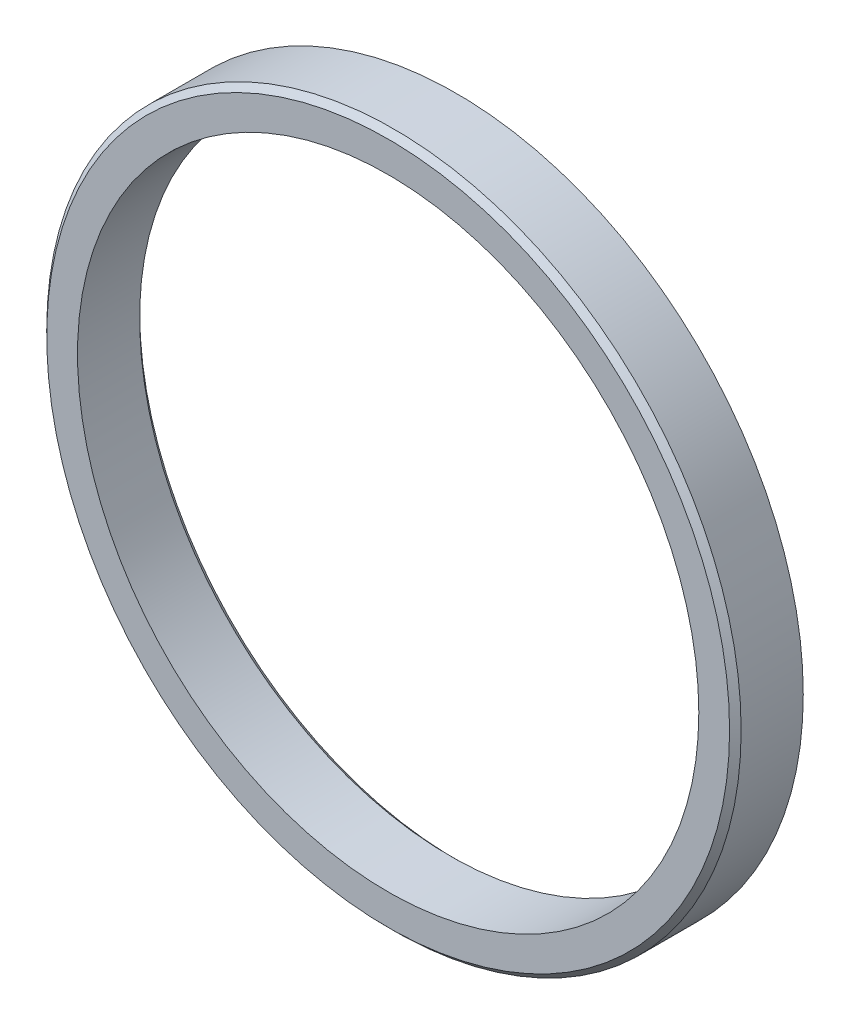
from build123d import *


with BuildPart() as part:
    # Sketch1 → Revolve1 (revolve)
    with BuildSketch(Plane(origin=(0, 0, 0), x_dir=(0, 0, -1), z_dir=(1, 0, 0)), mode=Mode.PRIVATE) as revolve1_sk:
        Polygon((-10.75, 107.5), (10.75, 107.5), (12.75, 109.5), (12.75, 120.15), (-8.75, 120.15), (-10.75, 118.15), align=None)
    revolve(revolve1_sk.sketch.rotate(Axis((0, 0, 66.622749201), (0, 0, -1)), 90), axis=Axis((0, 0, 66.622749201), (0, 0, -1)))


solid = part.part
